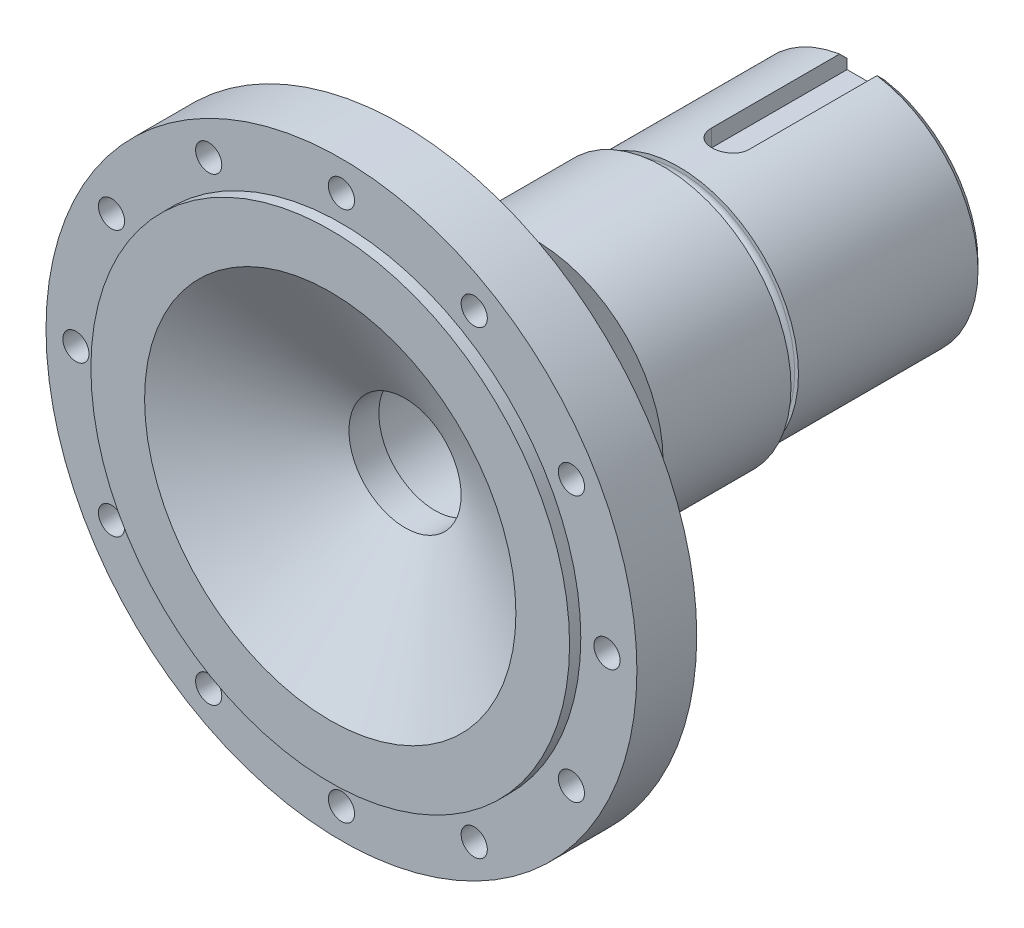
from build123d import *

# Parameters (mm, degrees)
ESQUISSE2_R                  = 1.75
ENL_V_MAT_EXTRU_1_DEPTH      = 92.383975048
R_P_TITION_CIRCULAIRE1_COUNT = 12
ENL_V_MAT_EXTRU_3_DEPTH      = 10
CHANFREIN2_SIZE              = 1


with BuildPart() as part:
    # Esquisse1 → R_volution1 (revolve)
    with BuildSketch(Plane(origin=(0, 0, 0), x_dir=(0, 0, -1), z_dir=(1, 0, 0)), mode=Mode.PRIVATE) as r_volution1_sk:
        with BuildLine():
            Line((28.222409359, 17), (16.722409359, 26.649645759))
            Line((16.722409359, 26.649645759), (16.722409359, 28))
            Line((16.722409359, 28), (10.222409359, 28))
            Line((10.222409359, 28), (10.222409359, 39.5))
            Line((10.222409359, 39.5), (2.222409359, 39.5))
            Line((2.222409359, 39.5), (2.222409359, 32))
            Line((2.222409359, 32), (0.722409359, 32))
            Line((0.722409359, 32), (0.722409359, 24.820508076))
            Line((0.722409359, 24.820508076), (10.722409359, 7.5))
            Line((10.722409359, 7.5), (14.722409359, 7.5))
            Line((14.722409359, 7.5), (14.722409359, 8.5))
            Line((14.722409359, 8.5), (62.322409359, 8.5))
            Line((62.322409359, 8.5), (62.322409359, 10.75))
            Line((62.322409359, 10.75), (64.041621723, 10.75))
            Line((64.041621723, 10.75), (72.322409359, 12.510135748))
            Line((72.322409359, 12.510135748), (72.322409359, 16))
            Line((72.322409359, 16), (47.322409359, 16))
            Line((47.322409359, 16), (47.322409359, 15.5))
            ThreePointArc((47.322409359, 15.5), (46.322409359, 14.5), (45.322409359, 15.5))
            Line((45.322409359, 15.5), (45.322409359, 17))
            Line((45.322409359, 17), (28.222409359, 17))
        make_face()
    revolve(r_volution1_sk.sketch.rotate(Axis((0, 0, 61.81759686), (0, 0, -1)), 90), axis=Axis((0, 0, 61.81759686), (0, 0, -1)))

    # Esquisse2 → Enl_v. mat.-Extru.1 (cut, through all)
    with BuildSketch(Plane.XY):
        with Locations((0, 35.5)):
            Circle(ESQUISSE2_R)
    enl_v_mat_extru_1 = extrude(amount=-ENL_V_MAT_EXTRU_1_DEPTH, mode=Mode.SUBTRACT)

    # R_p_tition circulaire1: Enl_v. mat.-Extru.1 ×12 about axis
    r_p_tition_circulaire1_axis = Axis((0, 0, 0), (0, 0, 1))
    for i in range(1, R_P_TITION_CIRCULAIRE1_COUNT):
        add(enl_v_mat_extru_1.rotate(r_p_tition_circulaire1_axis, i * 360 / R_P_TITION_CIRCULAIRE1_COUNT), mode=Mode.SUBTRACT)

    # Esquisse4 → Enl_v. mat.-Extru.3 (cut)
    with BuildSketch(Plane(origin=(0, 13.5, 0), x_dir=(-1, 0, 0), z_dir=(0, 1, 0))):
        with BuildLine():
            Line((-2.5, -72.479705), (-2.5, -54.222409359))
            ThreePointArc((-2.5, -54.222409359), (0, -51.722409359), (2.5, -54.222409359))
            Line((2.5, -54.222409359), (2.5, -72.479705))
            Line((2.5, -72.479705), (-2.5, -72.479705))
        make_face()
    extrude(amount=ENL_V_MAT_EXTRU_3_DEPTH, mode=Mode.SUBTRACT)

    # Chanfrein2
    chanfrein2_edges = [part.edges().sort_by_distance(p)[0] for p in [
        (-10.392304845, -12.165525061, -72.322409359),
    ]]
    chamfer(chanfrein2_edges, length=CHANFREIN2_SIZE)


solid = part.part
